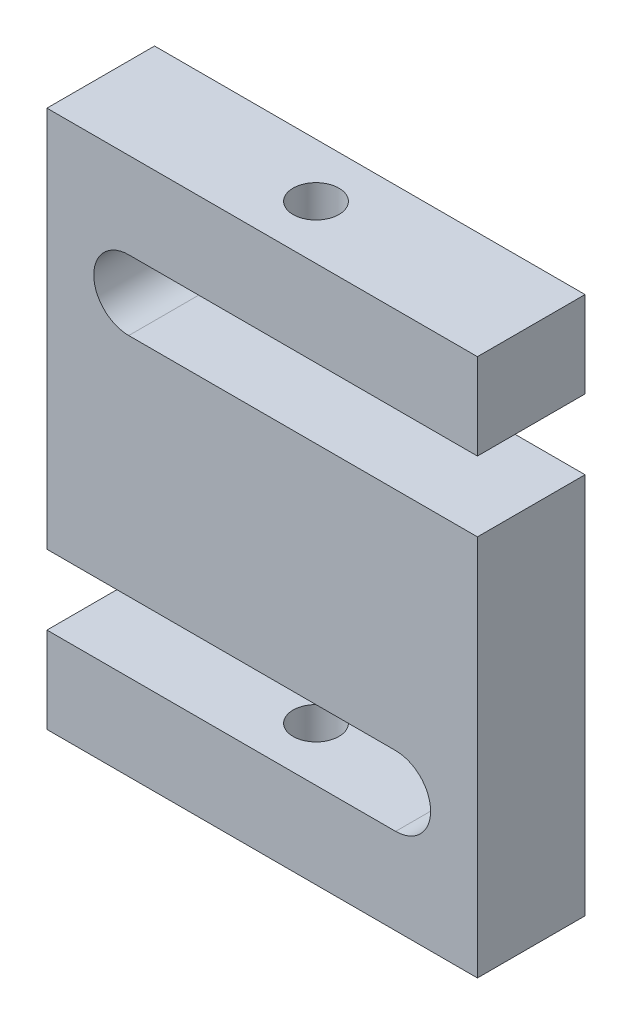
ISO-10303-21;
HEADER;
FILE_DESCRIPTION(('STEP AP214'),'2;1');
FILE_NAME('part.step','',(''),(''),'','','');
FILE_SCHEMA(('AUTOMOTIVE_DESIGN { 1 0 10303 214 1 1 1 1 }'));
ENDSEC;
DATA;
#1=APPLICATION_CONTEXT('core data for automotive mechanical design processes');
#2=APPLICATION_PROTOCOL_DEFINITION('international standard','automotive_design',2000,#1);
#3=PRODUCT_CONTEXT('',#1,'mechanical');
#4=PRODUCT('Part','Part','',(#3));
#5=PRODUCT_RELATED_PRODUCT_CATEGORY('part','',(#4));
#6=PRODUCT_DEFINITION_FORMATION('','',#4);
#7=PRODUCT_DEFINITION_CONTEXT('part definition',#1,'design');
#8=PRODUCT_DEFINITION('design','',#6,#7);
#9=PRODUCT_DEFINITION_SHAPE('','',#8);
#10=(LENGTH_UNIT() NAMED_UNIT(*) SI_UNIT(.MILLI.,.METRE.));
#11=(NAMED_UNIT(*) PLANE_ANGLE_UNIT() SI_UNIT($,.RADIAN.));
#12=(NAMED_UNIT(*) SI_UNIT($,.STERADIAN.) SOLID_ANGLE_UNIT());
#13=UNCERTAINTY_MEASURE_WITH_UNIT(LENGTH_MEASURE(1.E-05),#10,'distance_accuracy_value','');
#14=(GEOMETRIC_REPRESENTATION_CONTEXT(3) GLOBAL_UNCERTAINTY_ASSIGNED_CONTEXT((#13)) GLOBAL_UNIT_ASSIGNED_CONTEXT((#10,
#11,#12)) REPRESENTATION_CONTEXT('',''));
#15=CARTESIAN_POINT('',(0.,0.,0.));
#16=DIRECTION('',(0.,0.,1.));
#17=DIRECTION('',(1.,0.,0.));
#18=AXIS2_PLACEMENT_3D('',#15,#16,#17);
#19=CARTESIAN_POINT('',(-25.4,-31.75,6.35));
#20=DIRECTION('',(0.,1.,0.));
#21=DIRECTION('',(0.,0.,1.));
#22=AXIS2_PLACEMENT_3D('',#19,#20,#21);
#23=PLANE('',#22);
#24=DIRECTION('',(1.,0.,0.));
#25=VECTOR('',#24,1.);
#26=CARTESIAN_POINT('',(-25.4,-31.75,-6.35));
#27=LINE('',#26,#25);
#28=CARTESIAN_POINT('',(-25.4,-31.75,-6.35));
#29=VERTEX_POINT('',#28);
#30=CARTESIAN_POINT('',(25.4,-31.75,-6.35));
#31=VERTEX_POINT('',#30);
#32=EDGE_CURVE('E159',#29,#31,#27,.T.);
#33=ORIENTED_EDGE('',*,*,#32,.T.);
#34=DIRECTION('',(0.,0.,-1.));
#35=VECTOR('',#34,1.);
#36=CARTESIAN_POINT('',(25.4,-31.75,6.35));
#37=LINE('',#36,#35);
#38=CARTESIAN_POINT('',(25.4,-31.75,6.35));
#39=VERTEX_POINT('',#38);
#40=EDGE_CURVE('E44',#39,#31,#37,.T.);
#41=ORIENTED_EDGE('',*,*,#40,.F.);
#42=DIRECTION('',(1.,0.,0.));
#43=VECTOR('',#42,1.);
#44=CARTESIAN_POINT('',(-25.4,-31.75,6.35));
#45=LINE('',#44,#43);
#46=CARTESIAN_POINT('',(-25.4,-31.75,6.35));
#47=VERTEX_POINT('',#46);
#48=EDGE_CURVE('E107',#47,#39,#45,.T.);
#49=ORIENTED_EDGE('',*,*,#48,.F.);
#50=DIRECTION('',(0.,0.,-1.));
#51=VECTOR('',#50,1.);
#52=CARTESIAN_POINT('',(-25.4,-31.75,6.35));
#53=LINE('',#52,#51);
#54=EDGE_CURVE('E11',#47,#29,#53,.T.);
#55=ORIENTED_EDGE('',*,*,#54,.T.);
#56=EDGE_LOOP('',(#33,#41,#49,#55));
#57=FACE_BOUND('',#56,.T.);
#58=CARTESIAN_POINT('',(0.,-31.75,0.));
#59=DIRECTION('',(0.,-1.,0.));
#60=DIRECTION('',(0.,0.,-1.));
#61=AXIS2_PLACEMENT_3D('',#58,#59,#60);
#62=CIRCLE('',#61,2.70509999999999);
#63=CARTESIAN_POINT('',(0.,-31.75,-2.70509999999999));
#64=VERTEX_POINT('',#63);
#65=EDGE_CURVE('E361',#64,#64,#62,.T.);
#66=ORIENTED_EDGE('',*,*,#65,.F.);
#67=EDGE_LOOP('',(#66));
#68=FACE_BOUND('',#67,.T.);
#69=ADVANCED_FACE('F35',(#57,#68),#23,.F.);
#70=CARTESIAN_POINT('',(-25.4,-21.59,6.35));
#71=DIRECTION('',(1.,0.,0.));
#72=DIRECTION('',(0.,0.,-1.));
#73=AXIS2_PLACEMENT_3D('',#70,#71,#72);
#74=PLANE('',#73);
#75=DIRECTION('',(0.,-1.,0.));
#76=VECTOR('',#75,1.);
#77=CARTESIAN_POINT('',(-25.4,-21.59,-6.35));
#78=LINE('',#77,#76);
#79=CARTESIAN_POINT('',(-25.4,-21.59,-6.35));
#80=VERTEX_POINT('',#79);
#81=EDGE_CURVE('E156',#80,#29,#78,.T.);
#82=ORIENTED_EDGE('',*,*,#81,.T.);
#83=ORIENTED_EDGE('',*,*,#54,.F.);
#84=DIRECTION('',(0.,-1.,0.));
#85=VECTOR('',#84,1.);
#86=CARTESIAN_POINT('',(-25.4,-21.59,6.35));
#87=LINE('',#86,#85);
#88=CARTESIAN_POINT('',(-25.4,-21.59,6.35));
#89=VERTEX_POINT('',#88);
#90=EDGE_CURVE('E179',#89,#47,#87,.T.);
#91=ORIENTED_EDGE('',*,*,#90,.F.);
#92=DIRECTION('',(0.,0.,-1.));
#93=VECTOR('',#92,1.);
#94=CARTESIAN_POINT('',(-25.4,-21.59,6.35));
#95=LINE('',#94,#93);
#96=EDGE_CURVE('E152',#89,#80,#95,.T.);
#97=ORIENTED_EDGE('',*,*,#96,.T.);
#98=EDGE_LOOP('',(#82,#83,#91,#97));
#99=FACE_BOUND('',#98,.T.);
#100=ADVANCED_FACE('F37',(#99),#74,.F.);
#101=CARTESIAN_POINT('',(25.4,-31.75,6.35));
#102=DIRECTION('',(-1.,0.,0.));
#103=DIRECTION('',(0.,0.,1.));
#104=AXIS2_PLACEMENT_3D('',#101,#102,#103);
#105=PLANE('',#104);
#106=DIRECTION('',(0.,1.,0.));
#107=VECTOR('',#106,1.);
#108=CARTESIAN_POINT('',(25.4,-31.75,-6.35));
#109=LINE('',#108,#107);
#110=CARTESIAN_POINT('',(25.4,13.3349999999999,-6.35));
#111=VERTEX_POINT('',#110);
#112=EDGE_CURVE('E162',#31,#111,#109,.T.);
#113=ORIENTED_EDGE('',*,*,#112,.T.);
#114=DIRECTION('',(0.,0.,-1.));
#115=VECTOR('',#114,1.);
#116=CARTESIAN_POINT('',(25.4,13.3349999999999,6.35));
#117=LINE('',#116,#115);
#118=CARTESIAN_POINT('',(25.4,13.3349999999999,6.35));
#119=VERTEX_POINT('',#118);
#120=EDGE_CURVE('E198',#119,#111,#117,.T.);
#121=ORIENTED_EDGE('',*,*,#120,.F.);
#122=DIRECTION('',(0.,1.,0.));
#123=VECTOR('',#122,1.);
#124=CARTESIAN_POINT('',(25.4,-31.75,6.35));
#125=LINE('',#124,#123);
#126=EDGE_CURVE('E206',#39,#119,#125,.T.);
#127=ORIENTED_EDGE('',*,*,#126,.F.);
#128=ORIENTED_EDGE('',*,*,#40,.T.);
#129=EDGE_LOOP('',(#113,#121,#127,#128));
#130=FACE_BOUND('',#129,.T.);
#131=ADVANCED_FACE('F204',(#130),#105,.F.);
#132=CARTESIAN_POINT('',(-15.748,13.3349999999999,6.35));
#133=DIRECTION('',(0.,-1.,0.));
#134=DIRECTION('',(0.,0.,-1.));
#135=AXIS2_PLACEMENT_3D('',#132,#133,#134);
#136=PLANE('',#135);
#137=DIRECTION('',(-1.,0.,0.));
#138=VECTOR('',#137,1.);
#139=CARTESIAN_POINT('',(-15.748,13.3349999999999,-6.35));
#140=LINE('',#139,#138);
#141=CARTESIAN_POINT('',(-15.748,13.3349999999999,-6.35));
#142=VERTEX_POINT('',#141);
#143=EDGE_CURVE('E164',#111,#142,#140,.T.);
#144=ORIENTED_EDGE('',*,*,#143,.T.);
#145=DIRECTION('',(0.,0.,-1.));
#146=VECTOR('',#145,1.);
#147=CARTESIAN_POINT('',(-15.748,13.3349999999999,6.35));
#148=LINE('',#147,#146);
#149=CARTESIAN_POINT('',(-15.748,13.3349999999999,6.35));
#150=VERTEX_POINT('',#149);
#151=EDGE_CURVE('E195',#150,#142,#148,.T.);
#152=ORIENTED_EDGE('',*,*,#151,.F.);
#153=DIRECTION('',(-1.,0.,0.));
#154=VECTOR('',#153,1.);
#155=CARTESIAN_POINT('',(-15.748,13.3349999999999,6.35));
#156=LINE('',#155,#154);
#157=EDGE_CURVE('E224',#119,#150,#156,.T.);
#158=ORIENTED_EDGE('',*,*,#157,.F.);
#159=ORIENTED_EDGE('',*,*,#120,.T.);
#160=EDGE_LOOP('',(#144,#152,#158,#159));
#161=FACE_BOUND('',#160,.T.);
#162=ADVANCED_FACE('F215',(#161),#136,.F.);
#163=CARTESIAN_POINT('',(-15.748,17.4625,6.35));
#164=DIRECTION('',(0.,0.,-1.));
#165=DIRECTION('',(-1.,0.,0.));
#166=AXIS2_PLACEMENT_3D('',#163,#164,#165);
#167=CYLINDRICAL_SURFACE('',#166,4.12750000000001);
#168=CARTESIAN_POINT('',(-15.748,17.4625,-6.35));
#169=DIRECTION('',(0.,0.,-1.));
#170=DIRECTION('',(1.,0.,0.));
#171=AXIS2_PLACEMENT_3D('',#168,#169,#170);
#172=CIRCLE('',#171,4.12750000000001);
#173=CARTESIAN_POINT('',(-15.748,21.59,-6.35));
#174=VERTEX_POINT('',#173);
#175=EDGE_CURVE('E166',#142,#174,#172,.T.);
#176=ORIENTED_EDGE('',*,*,#175,.T.);
#177=DIRECTION('',(0.,0.,-1.));
#178=VECTOR('',#177,1.);
#179=CARTESIAN_POINT('',(-15.748,21.59,6.35));
#180=LINE('',#179,#178);
#181=CARTESIAN_POINT('',(-15.748,21.59,6.35));
#182=VERTEX_POINT('',#181);
#183=EDGE_CURVE('E192',#182,#174,#180,.T.);
#184=ORIENTED_EDGE('',*,*,#183,.F.);
#185=CARTESIAN_POINT('',(-15.748,17.4625,6.35));
#186=DIRECTION('',(0.,0.,-1.));
#187=DIRECTION('',(1.,0.,0.));
#188=AXIS2_PLACEMENT_3D('',#185,#186,#187);
#189=CIRCLE('',#188,4.12750000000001);
#190=EDGE_CURVE('E221',#150,#182,#189,.T.);
#191=ORIENTED_EDGE('',*,*,#190,.F.);
#192=ORIENTED_EDGE('',*,*,#151,.T.);
#193=EDGE_LOOP('',(#176,#184,#191,#192));
#194=FACE_BOUND('',#193,.T.);
#195=ADVANCED_FACE('F219',(#194),#167,.F.);
#196=CARTESIAN_POINT('',(-15.748,21.59,6.35));
#197=DIRECTION('',(0.,1.,0.));
#198=DIRECTION('',(-1.,0.,0.));
#199=AXIS2_PLACEMENT_3D('',#196,#197,#198);
#200=PLANE('',#199);
#201=CARTESIAN_POINT('',(0.,21.59,0.));
#202=DIRECTION('',(0.,1.,0.));
#203=DIRECTION('',(-1.,0.,0.));
#204=AXIS2_PLACEMENT_3D('',#201,#202,#203);
#205=CIRCLE('',#204,2.70509999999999);
#206=CARTESIAN_POINT('',(-2.70509999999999,21.59,0.));
#207=VERTEX_POINT('',#206);
#208=EDGE_CURVE('E160',#207,#207,#205,.T.);
#209=ORIENTED_EDGE('',*,*,#208,.T.);
#210=EDGE_LOOP('',(#209));
#211=FACE_BOUND('',#210,.T.);
#212=DIRECTION('',(1.,0.,0.));
#213=VECTOR('',#212,1.);
#214=CARTESIAN_POINT('',(-15.748,21.59,-6.35));
#215=LINE('',#214,#213);
#216=CARTESIAN_POINT('',(25.4,21.59,-6.35));
#217=VERTEX_POINT('',#216);
#218=EDGE_CURVE('E168',#174,#217,#215,.T.);
#219=ORIENTED_EDGE('',*,*,#218,.T.);
#220=DIRECTION('',(0.,0.,-1.));
#221=VECTOR('',#220,1.);
#222=CARTESIAN_POINT('',(25.4,21.59,6.35));
#223=LINE('',#222,#221);
#224=CARTESIAN_POINT('',(25.4,21.59,6.35));
#225=VERTEX_POINT('',#224);
#226=EDGE_CURVE('E189',#225,#217,#223,.T.);
#227=ORIENTED_EDGE('',*,*,#226,.F.);
#228=DIRECTION('',(1.,0.,0.));
#229=VECTOR('',#228,1.);
#230=CARTESIAN_POINT('',(-15.748,21.59,6.35));
#231=LINE('',#230,#229);
#232=EDGE_CURVE('E223',#182,#225,#231,.T.);
#233=ORIENTED_EDGE('',*,*,#232,.F.);
#234=ORIENTED_EDGE('',*,*,#183,.T.);
#235=EDGE_LOOP('',(#219,#227,#233,#234));
#236=FACE_BOUND('',#235,.T.);
#237=ADVANCED_FACE('F270',(#211,#236),#200,.F.);
#238=CARTESIAN_POINT('',(25.4,21.59,6.35));
#239=DIRECTION('',(-1.,0.,0.));
#240=DIRECTION('',(0.,0.,1.));
#241=AXIS2_PLACEMENT_3D('',#238,#239,#240);
#242=PLANE('',#241);
#243=DIRECTION('',(0.,1.,0.));
#244=VECTOR('',#243,1.);
#245=CARTESIAN_POINT('',(25.4,21.59,-6.35));
#246=LINE('',#245,#244);
#247=CARTESIAN_POINT('',(25.4,31.75,-6.35));
#248=VERTEX_POINT('',#247);
#249=EDGE_CURVE('E170',#217,#248,#246,.T.);
#250=ORIENTED_EDGE('',*,*,#249,.T.);
#251=DIRECTION('',(0.,0.,-1.));
#252=VECTOR('',#251,1.);
#253=CARTESIAN_POINT('',(25.4,31.75,6.35));
#254=LINE('',#253,#252);
#255=CARTESIAN_POINT('',(25.4,31.75,6.35));
#256=VERTEX_POINT('',#255);
#257=EDGE_CURVE('E186',#256,#248,#254,.T.);
#258=ORIENTED_EDGE('',*,*,#257,.F.);
#259=DIRECTION('',(0.,1.,0.));
#260=VECTOR('',#259,1.);
#261=CARTESIAN_POINT('',(25.4,21.59,6.35));
#262=LINE('',#261,#260);
#263=EDGE_CURVE('E226',#225,#256,#262,.T.);
#264=ORIENTED_EDGE('',*,*,#263,.F.);
#265=ORIENTED_EDGE('',*,*,#226,.T.);
#266=EDGE_LOOP('',(#250,#258,#264,#265));
#267=FACE_BOUND('',#266,.T.);
#268=ADVANCED_FACE('F273',(#267),#242,.F.);
#269=CARTESIAN_POINT('',(25.4,31.75,6.35));
#270=DIRECTION('',(0.,-1.,0.));
#271=DIRECTION('',(0.,0.,-1.));
#272=AXIS2_PLACEMENT_3D('',#269,#270,#271);
#273=PLANE('',#272);
#274=CARTESIAN_POINT('',(0.,31.75,0.));
#275=DIRECTION('',(0.,1.,0.));
#276=DIRECTION('',(0.,0.,1.));
#277=AXIS2_PLACEMENT_3D('',#274,#275,#276);
#278=CIRCLE('',#277,2.70509999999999);
#279=CARTESIAN_POINT('',(0.,31.75,2.70509999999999));
#280=VERTEX_POINT('',#279);
#281=EDGE_CURVE('E363',#280,#280,#278,.T.);
#282=ORIENTED_EDGE('',*,*,#281,.F.);
#283=EDGE_LOOP('',(#282));
#284=FACE_BOUND('',#283,.T.);
#285=DIRECTION('',(-1.,0.,0.));
#286=VECTOR('',#285,1.);
#287=CARTESIAN_POINT('',(25.4,31.75,-6.35));
#288=LINE('',#287,#286);
#289=CARTESIAN_POINT('',(-25.4,31.75,-6.35));
#290=VERTEX_POINT('',#289);
#291=EDGE_CURVE('E172',#248,#290,#288,.T.);
#292=ORIENTED_EDGE('',*,*,#291,.T.);
#293=DIRECTION('',(0.,0.,-1.));
#294=VECTOR('',#293,1.);
#295=CARTESIAN_POINT('',(-25.4,31.75,6.35));
#296=LINE('',#295,#294);
#297=CARTESIAN_POINT('',(-25.4,31.75,6.35));
#298=VERTEX_POINT('',#297);
#299=EDGE_CURVE('E183',#298,#290,#296,.T.);
#300=ORIENTED_EDGE('',*,*,#299,.F.);
#301=DIRECTION('',(-1.,0.,0.));
#302=VECTOR('',#301,1.);
#303=CARTESIAN_POINT('',(25.4,31.75,6.35));
#304=LINE('',#303,#302);
#305=EDGE_CURVE('E232',#256,#298,#304,.T.);
#306=ORIENTED_EDGE('',*,*,#305,.F.);
#307=ORIENTED_EDGE('',*,*,#257,.T.);
#308=EDGE_LOOP('',(#292,#300,#306,#307));
#309=FACE_BOUND('',#308,.T.);
#310=ADVANCED_FACE('F238',(#284,#309),#273,.F.);
#311=CARTESIAN_POINT('',(-25.4,31.75,6.35));
#312=DIRECTION('',(1.,0.,0.));
#313=DIRECTION('',(0.,1.,0.));
#314=AXIS2_PLACEMENT_3D('',#311,#312,#313);
#315=PLANE('',#314);
#316=DIRECTION('',(0.,-1.,0.));
#317=VECTOR('',#316,1.);
#318=CARTESIAN_POINT('',(-25.4,31.75,-6.35));
#319=LINE('',#318,#317);
#320=CARTESIAN_POINT('',(-25.4,-13.335,-6.35));
#321=VERTEX_POINT('',#320);
#322=EDGE_CURVE('E174',#290,#321,#319,.T.);
#323=ORIENTED_EDGE('',*,*,#322,.T.);
#324=DIRECTION('',(0.,0.,-1.));
#325=VECTOR('',#324,1.);
#326=CARTESIAN_POINT('',(-25.4,-13.335,6.35));
#327=LINE('',#326,#325);
#328=CARTESIAN_POINT('',(-25.4,-13.335,6.35));
#329=VERTEX_POINT('',#328);
#330=EDGE_CURVE('E147',#329,#321,#327,.T.);
#331=ORIENTED_EDGE('',*,*,#330,.F.);
#332=DIRECTION('',(0.,-1.,0.));
#333=VECTOR('',#332,1.);
#334=CARTESIAN_POINT('',(-25.4,31.75,6.35));
#335=LINE('',#334,#333);
#336=EDGE_CURVE('E138',#298,#329,#335,.T.);
#337=ORIENTED_EDGE('',*,*,#336,.F.);
#338=ORIENTED_EDGE('',*,*,#299,.T.);
#339=EDGE_LOOP('',(#323,#331,#337,#338));
#340=FACE_BOUND('',#339,.T.);
#341=ADVANCED_FACE('F242',(#340),#315,.F.);
#342=CARTESIAN_POINT('',(-25.4,-13.335,6.35));
#343=DIRECTION('',(0.,1.,0.));
#344=DIRECTION('',(-1.,0.,0.));
#345=AXIS2_PLACEMENT_3D('',#342,#343,#344);
#346=PLANE('',#345);
#347=DIRECTION('',(1.,0.,0.));
#348=VECTOR('',#347,1.);
#349=CARTESIAN_POINT('',(-25.4,-13.335,-6.35));
#350=LINE('',#349,#348);
#351=CARTESIAN_POINT('',(15.748,-13.335,-6.35));
#352=VERTEX_POINT('',#351);
#353=EDGE_CURVE('E146',#321,#352,#350,.T.);
#354=ORIENTED_EDGE('',*,*,#353,.T.);
#355=DIRECTION('',(0.,0.,-1.));
#356=VECTOR('',#355,1.);
#357=CARTESIAN_POINT('',(15.748,-13.335,6.35));
#358=LINE('',#357,#356);
#359=CARTESIAN_POINT('',(15.748,-13.335,6.35));
#360=VERTEX_POINT('',#359);
#361=EDGE_CURVE('E143',#360,#352,#358,.T.);
#362=ORIENTED_EDGE('',*,*,#361,.F.);
#363=DIRECTION('',(1.,0.,0.));
#364=VECTOR('',#363,1.);
#365=CARTESIAN_POINT('',(-25.4,-13.335,6.35));
#366=LINE('',#365,#364);
#367=EDGE_CURVE('E132',#329,#360,#366,.T.);
#368=ORIENTED_EDGE('',*,*,#367,.F.);
#369=ORIENTED_EDGE('',*,*,#330,.T.);
#370=EDGE_LOOP('',(#354,#362,#368,#369));
#371=FACE_BOUND('',#370,.T.);
#372=ADVANCED_FACE('F144',(#371),#346,.F.);
#373=CARTESIAN_POINT('',(15.748,-17.4625,6.35));
#374=DIRECTION('',(0.,0.,-1.));
#375=DIRECTION('',(-1.,0.,0.));
#376=AXIS2_PLACEMENT_3D('',#373,#374,#375);
#377=CYLINDRICAL_SURFACE('',#376,4.12750000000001);
#378=CARTESIAN_POINT('',(15.748,-17.4625,-6.35));
#379=DIRECTION('',(0.,0.,-1.));
#380=DIRECTION('',(1.,0.,0.));
#381=AXIS2_PLACEMENT_3D('',#378,#379,#380);
#382=CIRCLE('',#381,4.12750000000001);
#383=CARTESIAN_POINT('',(15.748,-21.59,-6.35));
#384=VERTEX_POINT('',#383);
#385=EDGE_CURVE('E93',#352,#384,#382,.T.);
#386=ORIENTED_EDGE('',*,*,#385,.T.);
#387=DIRECTION('',(0.,0.,-1.));
#388=VECTOR('',#387,1.);
#389=CARTESIAN_POINT('',(15.748,-21.59,6.35));
#390=LINE('',#389,#388);
#391=CARTESIAN_POINT('',(15.748,-21.59,6.35));
#392=VERTEX_POINT('',#391);
#393=EDGE_CURVE('E148',#392,#384,#390,.T.);
#394=ORIENTED_EDGE('',*,*,#393,.F.);
#395=CARTESIAN_POINT('',(15.748,-17.4625,6.35));
#396=DIRECTION('',(0.,0.,-1.));
#397=DIRECTION('',(1.,0.,0.));
#398=AXIS2_PLACEMENT_3D('',#395,#396,#397);
#399=CIRCLE('',#398,4.12750000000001);
#400=EDGE_CURVE('E136',#360,#392,#399,.T.);
#401=ORIENTED_EDGE('',*,*,#400,.F.);
#402=ORIENTED_EDGE('',*,*,#361,.T.);
#403=EDGE_LOOP('',(#386,#394,#401,#402));
#404=FACE_BOUND('',#403,.T.);
#405=ADVANCED_FACE('F150',(#404),#377,.F.);
#406=CARTESIAN_POINT('',(-25.4,-21.59,6.35));
#407=DIRECTION('',(0.,-1.,0.));
#408=DIRECTION('',(0.,0.,-1.));
#409=AXIS2_PLACEMENT_3D('',#406,#407,#408);
#410=PLANE('',#409);
#411=CARTESIAN_POINT('',(0.,-21.59,0.));
#412=DIRECTION('',(0.,-1.,0.));
#413=DIRECTION('',(0.,0.,-1.));
#414=AXIS2_PLACEMENT_3D('',#411,#412,#413);
#415=CIRCLE('',#414,2.70509999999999);
#416=CARTESIAN_POINT('',(0.,-21.59,-2.70509999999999));
#417=VERTEX_POINT('',#416);
#418=EDGE_CURVE('E358',#417,#417,#415,.T.);
#419=ORIENTED_EDGE('',*,*,#418,.T.);
#420=EDGE_LOOP('',(#419));
#421=FACE_BOUND('',#420,.T.);
#422=DIRECTION('',(-1.,0.,0.));
#423=VECTOR('',#422,1.);
#424=CARTESIAN_POINT('',(-25.4,-21.59,-6.35));
#425=LINE('',#424,#423);
#426=EDGE_CURVE('E99',#384,#80,#425,.T.);
#427=ORIENTED_EDGE('',*,*,#426,.T.);
#428=ORIENTED_EDGE('',*,*,#96,.F.);
#429=DIRECTION('',(-1.,0.,0.));
#430=VECTOR('',#429,1.);
#431=CARTESIAN_POINT('',(-25.4,-21.59,6.35));
#432=LINE('',#431,#430);
#433=EDGE_CURVE('E52',#392,#89,#432,.T.);
#434=ORIENTED_EDGE('',*,*,#433,.F.);
#435=ORIENTED_EDGE('',*,*,#393,.T.);
#436=EDGE_LOOP('',(#427,#428,#434,#435));
#437=FACE_BOUND('',#436,.T.);
#438=ADVANCED_FACE('F246',(#421,#437),#410,.F.);
#439=CARTESIAN_POINT('',(-15.748,17.4625,6.35));
#440=DIRECTION('',(0.,0.,1.));
#441=DIRECTION('',(1.,0.,0.));
#442=AXIS2_PLACEMENT_3D('',#439,#440,#441);
#443=PLANE('',#442);
#444=ORIENTED_EDGE('',*,*,#90,.T.);
#445=ORIENTED_EDGE('',*,*,#48,.T.);
#446=ORIENTED_EDGE('',*,*,#126,.T.);
#447=ORIENTED_EDGE('',*,*,#157,.T.);
#448=ORIENTED_EDGE('',*,*,#190,.T.);
#449=ORIENTED_EDGE('',*,*,#232,.T.);
#450=ORIENTED_EDGE('',*,*,#263,.T.);
#451=ORIENTED_EDGE('',*,*,#305,.T.);
#452=ORIENTED_EDGE('',*,*,#336,.T.);
#453=ORIENTED_EDGE('',*,*,#367,.T.);
#454=ORIENTED_EDGE('',*,*,#400,.T.);
#455=ORIENTED_EDGE('',*,*,#433,.T.);
#456=EDGE_LOOP('',(#444,#445,#446,#447,#448,#449,#450,#451,#452,#453,#454,#455));
#457=FACE_BOUND('',#456,.T.);
#458=ADVANCED_FACE('F134',(#457),#443,.T.);
#459=CARTESIAN_POINT('',(-15.748,17.4625,-6.35));
#460=DIRECTION('',(0.,0.,1.));
#461=DIRECTION('',(1.,0.,0.));
#462=AXIS2_PLACEMENT_3D('',#459,#460,#461);
#463=PLANE('',#462);
#464=ORIENTED_EDGE('',*,*,#81,.F.);
#465=ORIENTED_EDGE('',*,*,#426,.F.);
#466=ORIENTED_EDGE('',*,*,#385,.F.);
#467=ORIENTED_EDGE('',*,*,#353,.F.);
#468=ORIENTED_EDGE('',*,*,#322,.F.);
#469=ORIENTED_EDGE('',*,*,#291,.F.);
#470=ORIENTED_EDGE('',*,*,#249,.F.);
#471=ORIENTED_EDGE('',*,*,#218,.F.);
#472=ORIENTED_EDGE('',*,*,#175,.F.);
#473=ORIENTED_EDGE('',*,*,#143,.F.);
#474=ORIENTED_EDGE('',*,*,#112,.F.);
#475=ORIENTED_EDGE('',*,*,#32,.F.);
#476=EDGE_LOOP('',(#464,#465,#466,#467,#468,#469,#470,#471,#472,#473,#474,#475));
#477=FACE_BOUND('',#476,.T.);
#478=ADVANCED_FACE('F210',(#477),#463,.F.);
#479=CARTESIAN_POINT('',(0.,31.75,0.));
#480=DIRECTION('',(0.,1.,0.));
#481=DIRECTION('',(0.,0.,1.));
#482=AXIS2_PLACEMENT_3D('',#479,#480,#481);
#483=CYLINDRICAL_SURFACE('',#482,2.70509999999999);
#484=ORIENTED_EDGE('',*,*,#208,.F.);
#485=EDGE_LOOP('',(#484));
#486=FACE_BOUND('',#485,.T.);
#487=ORIENTED_EDGE('',*,*,#281,.T.);
#488=EDGE_LOOP('',(#487));
#489=FACE_BOUND('',#488,.T.);
#490=ADVANCED_FACE('F308',(#486,#489),#483,.F.);
#491=CARTESIAN_POINT('',(0.,-31.75,0.));
#492=DIRECTION('',(0.,-1.,0.));
#493=DIRECTION('',(0.,0.,-1.));
#494=AXIS2_PLACEMENT_3D('',#491,#492,#493);
#495=CYLINDRICAL_SURFACE('',#494,2.70509999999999);
#496=ORIENTED_EDGE('',*,*,#418,.F.);
#497=EDGE_LOOP('',(#496));
#498=FACE_BOUND('',#497,.T.);
#499=ORIENTED_EDGE('',*,*,#65,.T.);
#500=EDGE_LOOP('',(#499));
#501=FACE_BOUND('',#500,.T.);
#502=ADVANCED_FACE('F331',(#498,#501),#495,.F.);
#503=CLOSED_SHELL('',(#69,#100,#131,#162,#195,#237,#268,#310,#341,#372,#405,#438,#458,#478,#490,#502));
#504=MANIFOLD_SOLID_BREP('B2',#503);
#505=ADVANCED_BREP_SHAPE_REPRESENTATION('',(#18,#504),#14);
#506=SHAPE_DEFINITION_REPRESENTATION(#9,#505);
ENDSEC;
END-ISO-10303-21;
